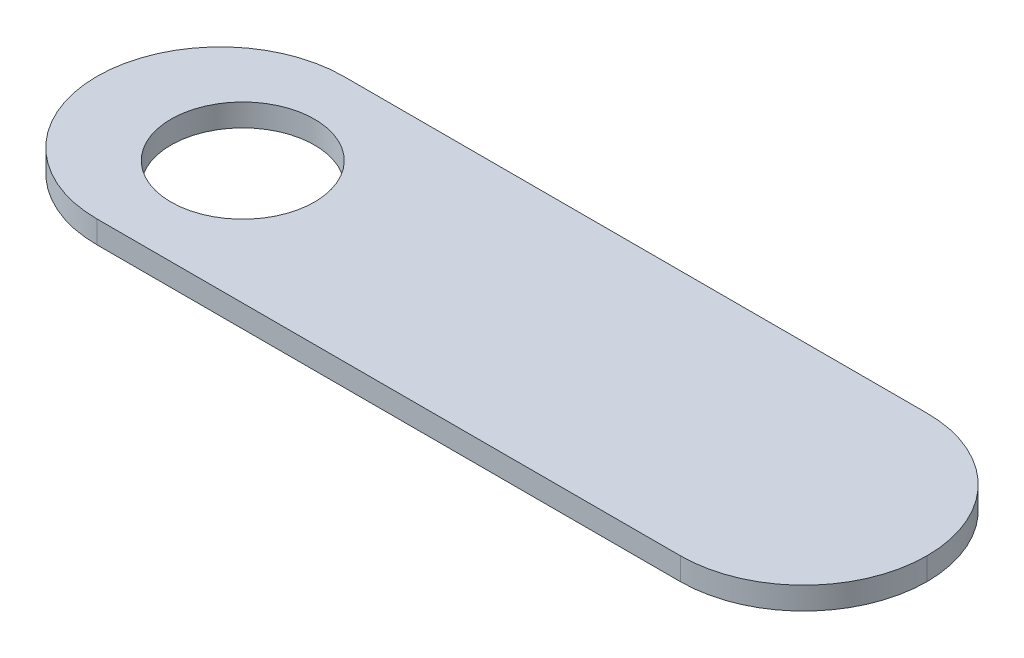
ISO-10303-21;
HEADER;
FILE_DESCRIPTION(('STEP AP214'),'2;1');
FILE_NAME('part.step','',(''),(''),'','','');
FILE_SCHEMA(('AUTOMOTIVE_DESIGN { 1 0 10303 214 1 1 1 1 }'));
ENDSEC;
DATA;
#1=APPLICATION_CONTEXT('core data for automotive mechanical design processes');
#2=APPLICATION_PROTOCOL_DEFINITION('international standard','automotive_design',2000,#1);
#3=PRODUCT_CONTEXT('',#1,'mechanical');
#4=PRODUCT('Part','Part','',(#3));
#5=PRODUCT_RELATED_PRODUCT_CATEGORY('part','',(#4));
#6=PRODUCT_DEFINITION_FORMATION('','',#4);
#7=PRODUCT_DEFINITION_CONTEXT('part definition',#1,'design');
#8=PRODUCT_DEFINITION('design','',#6,#7);
#9=PRODUCT_DEFINITION_SHAPE('','',#8);
#10=(LENGTH_UNIT() NAMED_UNIT(*) SI_UNIT(.MILLI.,.METRE.));
#11=(NAMED_UNIT(*) PLANE_ANGLE_UNIT() SI_UNIT($,.RADIAN.));
#12=(NAMED_UNIT(*) SI_UNIT($,.STERADIAN.) SOLID_ANGLE_UNIT());
#13=UNCERTAINTY_MEASURE_WITH_UNIT(LENGTH_MEASURE(1.E-05),#10,'distance_accuracy_value','');
#14=(GEOMETRIC_REPRESENTATION_CONTEXT(3) GLOBAL_UNCERTAINTY_ASSIGNED_CONTEXT((#13)) GLOBAL_UNIT_ASSIGNED_CONTEXT((#10,
#11,#12)) REPRESENTATION_CONTEXT('',''));
#15=CARTESIAN_POINT('',(0.,0.,0.));
#16=DIRECTION('',(0.,0.,1.));
#17=DIRECTION('',(1.,0.,0.));
#18=AXIS2_PLACEMENT_3D('',#15,#16,#17);
#19=CARTESIAN_POINT('',(-9.25,0.5,-2.75));
#20=DIRECTION('',(0.,0.,1.));
#21=DIRECTION('',(1.,0.,0.));
#22=AXIS2_PLACEMENT_3D('',#19,#20,#21);
#23=PLANE('',#22);
#24=DIRECTION('',(-1.,0.,0.));
#25=VECTOR('',#24,1.);
#26=CARTESIAN_POINT('',(-9.25,0.,-2.75));
#27=LINE('',#26,#25);
#28=CARTESIAN_POINT('',(6.5,0.,-2.75));
#29=VERTEX_POINT('',#28);
#30=CARTESIAN_POINT('',(-6.5,0.,-2.75));
#31=VERTEX_POINT('',#30);
#32=EDGE_CURVE('E99',#29,#31,#27,.T.);
#33=ORIENTED_EDGE('',*,*,#32,.T.);
#34=DIRECTION('',(0.,-1.,0.));
#35=VECTOR('',#34,1.);
#36=CARTESIAN_POINT('',(-6.5,0.5,-2.75));
#37=LINE('',#36,#35);
#38=CARTESIAN_POINT('',(-6.5,0.5,-2.75));
#39=VERTEX_POINT('',#38);
#40=EDGE_CURVE('E117',#31,#39,#37,.F.);
#41=ORIENTED_EDGE('',*,*,#40,.T.);
#42=DIRECTION('',(-1.,0.,0.));
#43=VECTOR('',#42,1.);
#44=CARTESIAN_POINT('',(-9.25,0.5,-2.75));
#45=LINE('',#44,#43);
#46=CARTESIAN_POINT('',(6.5,0.5,-2.75));
#47=VERTEX_POINT('',#46);
#48=EDGE_CURVE('E138',#47,#39,#45,.T.);
#49=ORIENTED_EDGE('',*,*,#48,.F.);
#50=DIRECTION('',(0.,-1.,0.));
#51=VECTOR('',#50,1.);
#52=CARTESIAN_POINT('',(6.5,0.5,-2.75));
#53=LINE('',#52,#51);
#54=EDGE_CURVE('E115',#47,#29,#53,.T.);
#55=ORIENTED_EDGE('',*,*,#54,.T.);
#56=EDGE_LOOP('',(#33,#41,#49,#55));
#57=FACE_BOUND('',#56,.T.);
#58=ADVANCED_FACE('F35',(#57),#23,.F.);
#59=CARTESIAN_POINT('',(-9.25,0.5,2.75));
#60=DIRECTION('',(0.,0.,-1.));
#61=DIRECTION('',(-1.,0.,0.));
#62=AXIS2_PLACEMENT_3D('',#59,#60,#61);
#63=PLANE('',#62);
#64=DIRECTION('',(1.,0.,0.));
#65=VECTOR('',#64,1.);
#66=CARTESIAN_POINT('',(-9.25,0.5,2.75));
#67=LINE('',#66,#65);
#68=CARTESIAN_POINT('',(-6.5,0.5,2.75));
#69=VERTEX_POINT('',#68);
#70=CARTESIAN_POINT('',(6.5,0.5,2.75));
#71=VERTEX_POINT('',#70);
#72=EDGE_CURVE('E102',#69,#71,#67,.T.);
#73=ORIENTED_EDGE('',*,*,#72,.F.);
#74=DIRECTION('',(0.,-1.,0.));
#75=VECTOR('',#74,1.);
#76=CARTESIAN_POINT('',(-6.5,0.5,2.75));
#77=LINE('',#76,#75);
#78=CARTESIAN_POINT('',(-6.5,0.,2.75));
#79=VERTEX_POINT('',#78);
#80=EDGE_CURVE('E11',#69,#79,#77,.T.);
#81=ORIENTED_EDGE('',*,*,#80,.T.);
#82=DIRECTION('',(1.,0.,0.));
#83=VECTOR('',#82,1.);
#84=CARTESIAN_POINT('',(-9.25,0.,2.75));
#85=LINE('',#84,#83);
#86=CARTESIAN_POINT('',(6.5,0.,2.75));
#87=VERTEX_POINT('',#86);
#88=EDGE_CURVE('E141',#79,#87,#85,.T.);
#89=ORIENTED_EDGE('',*,*,#88,.T.);
#90=DIRECTION('',(0.,-1.,0.));
#91=VECTOR('',#90,1.);
#92=CARTESIAN_POINT('',(6.5,0.5,2.75));
#93=LINE('',#92,#91);
#94=EDGE_CURVE('E44',#87,#71,#93,.F.);
#95=ORIENTED_EDGE('',*,*,#94,.T.);
#96=EDGE_LOOP('',(#73,#81,#89,#95));
#97=FACE_BOUND('',#96,.T.);
#98=ADVANCED_FACE('F144',(#97),#63,.F.);
#99=CARTESIAN_POINT('',(0.,0.5,0.));
#100=DIRECTION('',(0.,-1.,0.));
#101=DIRECTION('',(0.,0.,-1.));
#102=AXIS2_PLACEMENT_3D('',#99,#100,#101);
#103=PLANE('',#102);
#104=CARTESIAN_POINT('',(-6.,0.500000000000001,0.));
#105=DIRECTION('',(0.,1.,0.));
#106=DIRECTION('',(0.,0.,1.));
#107=AXIS2_PLACEMENT_3D('',#104,#105,#106);
#108=CIRCLE('',#107,1.59999999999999);
#109=CARTESIAN_POINT('',(-6.,0.500000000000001,1.59999999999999));
#110=VERTEX_POINT('',#109);
#111=EDGE_CURVE('E126',#110,#110,#108,.T.);
#112=ORIENTED_EDGE('',*,*,#111,.F.);
#113=EDGE_LOOP('',(#112));
#114=FACE_BOUND('',#113,.T.);
#115=ORIENTED_EDGE('',*,*,#48,.T.);
#116=CARTESIAN_POINT('',(-6.5,0.5,0.));
#117=DIRECTION('',(0.,-1.,0.));
#118=DIRECTION('',(0.,0.,-1.));
#119=AXIS2_PLACEMENT_3D('',#116,#117,#118);
#120=CIRCLE('',#119,2.75);
#121=CARTESIAN_POINT('',(-9.25,0.5,0.));
#122=VERTEX_POINT('',#121);
#123=EDGE_CURVE('E123',#39,#122,#120,.F.);
#124=ORIENTED_EDGE('',*,*,#123,.T.);
#125=CARTESIAN_POINT('',(-6.5,0.5,0.));
#126=DIRECTION('',(0.,-1.,0.));
#127=DIRECTION('',(0.,0.,-1.));
#128=AXIS2_PLACEMENT_3D('',#125,#126,#127);
#129=CIRCLE('',#128,2.75);
#130=EDGE_CURVE('E60',#122,#69,#129,.F.);
#131=ORIENTED_EDGE('',*,*,#130,.T.);
#132=ORIENTED_EDGE('',*,*,#72,.T.);
#133=CARTESIAN_POINT('',(6.5,0.5,0.));
#134=DIRECTION('',(0.,-1.,0.));
#135=DIRECTION('',(0.,0.,-1.));
#136=AXIS2_PLACEMENT_3D('',#133,#134,#135);
#137=CIRCLE('',#136,2.75);
#138=CARTESIAN_POINT('',(9.25,0.5,0.));
#139=VERTEX_POINT('',#138);
#140=EDGE_CURVE('E52',#71,#139,#137,.F.);
#141=ORIENTED_EDGE('',*,*,#140,.T.);
#142=CARTESIAN_POINT('',(6.5,0.5,0.));
#143=DIRECTION('',(0.,-1.,0.));
#144=DIRECTION('',(0.,0.,-1.));
#145=AXIS2_PLACEMENT_3D('',#142,#143,#144);
#146=CIRCLE('',#145,2.75);
#147=EDGE_CURVE('E105',#139,#47,#146,.F.);
#148=ORIENTED_EDGE('',*,*,#147,.T.);
#149=EDGE_LOOP('',(#115,#124,#131,#132,#141,#148));
#150=FACE_BOUND('',#149,.T.);
#151=ADVANCED_FACE('F153',(#114,#150),#103,.F.);
#152=CARTESIAN_POINT('',(0.,0.,0.));
#153=DIRECTION('',(0.,-1.,0.));
#154=DIRECTION('',(0.,0.,-1.));
#155=AXIS2_PLACEMENT_3D('',#152,#153,#154);
#156=PLANE('',#155);
#157=CARTESIAN_POINT('',(-6.,0.,0.));
#158=DIRECTION('',(0.,1.,0.));
#159=DIRECTION('',(0.,0.,1.));
#160=AXIS2_PLACEMENT_3D('',#157,#158,#159);
#161=CIRCLE('',#160,1.6);
#162=CARTESIAN_POINT('',(-6.,0.,1.6));
#163=VERTEX_POINT('',#162);
#164=EDGE_CURVE('E131',#163,#163,#161,.T.);
#165=ORIENTED_EDGE('',*,*,#164,.T.);
#166=EDGE_LOOP('',(#165));
#167=FACE_BOUND('',#166,.T.);
#168=CARTESIAN_POINT('',(-6.5,0.,0.));
#169=DIRECTION('',(0.,-1.,0.));
#170=DIRECTION('',(0.,0.,-1.));
#171=AXIS2_PLACEMENT_3D('',#168,#169,#170);
#172=CIRCLE('',#171,2.75);
#173=CARTESIAN_POINT('',(-9.25,0.,0.));
#174=VERTEX_POINT('',#173);
#175=EDGE_CURVE('E108',#79,#174,#172,.T.);
#176=ORIENTED_EDGE('',*,*,#175,.T.);
#177=CARTESIAN_POINT('',(-6.5,0.,0.));
#178=DIRECTION('',(0.,-1.,0.));
#179=DIRECTION('',(0.,0.,-1.));
#180=AXIS2_PLACEMENT_3D('',#177,#178,#179);
#181=CIRCLE('',#180,2.75);
#182=EDGE_CURVE('E110',#174,#31,#181,.T.);
#183=ORIENTED_EDGE('',*,*,#182,.T.);
#184=ORIENTED_EDGE('',*,*,#32,.F.);
#185=CARTESIAN_POINT('',(6.5,0.,0.));
#186=DIRECTION('',(0.,-1.,0.));
#187=DIRECTION('',(0.,0.,-1.));
#188=AXIS2_PLACEMENT_3D('',#185,#186,#187);
#189=CIRCLE('',#188,2.75);
#190=CARTESIAN_POINT('',(9.25,0.,0.));
#191=VERTEX_POINT('',#190);
#192=EDGE_CURVE('E91',#29,#191,#189,.T.);
#193=ORIENTED_EDGE('',*,*,#192,.T.);
#194=CARTESIAN_POINT('',(6.5,0.,0.));
#195=DIRECTION('',(0.,-1.,0.));
#196=DIRECTION('',(0.,0.,-1.));
#197=AXIS2_PLACEMENT_3D('',#194,#195,#196);
#198=CIRCLE('',#197,2.75);
#199=EDGE_CURVE('E96',#191,#87,#198,.T.);
#200=ORIENTED_EDGE('',*,*,#199,.T.);
#201=ORIENTED_EDGE('',*,*,#88,.F.);
#202=EDGE_LOOP('',(#176,#183,#184,#193,#200,#201));
#203=FACE_BOUND('',#202,.T.);
#204=ADVANCED_FACE('F93',(#167,#203),#156,.T.);
#205=CARTESIAN_POINT('',(-6.,0.5,0.));
#206=DIRECTION('',(0.,1.,0.));
#207=DIRECTION('',(0.,0.,1.));
#208=AXIS2_PLACEMENT_3D('',#205,#206,#207);
#209=CYLINDRICAL_SURFACE('',#208,1.59999999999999);
#210=ORIENTED_EDGE('',*,*,#164,.F.);
#211=EDGE_LOOP('',(#210));
#212=FACE_BOUND('',#211,.T.);
#213=ORIENTED_EDGE('',*,*,#111,.T.);
#214=EDGE_LOOP('',(#213));
#215=FACE_BOUND('',#214,.T.);
#216=ADVANCED_FACE('F161',(#212,#215),#209,.F.);
#217=CARTESIAN_POINT('',(-6.5,0.5,0.));
#218=DIRECTION('',(0.,-1.,0.));
#219=DIRECTION('',(0.,0.,-1.));
#220=AXIS2_PLACEMENT_3D('',#217,#218,#219);
#221=CYLINDRICAL_SURFACE('',#220,2.75);
#222=ORIENTED_EDGE('',*,*,#80,.F.);
#223=ORIENTED_EDGE('',*,*,#130,.F.);
#224=DIRECTION('',(0.,-1.,0.));
#225=VECTOR('',#224,1.);
#226=CARTESIAN_POINT('',(-9.25,0.5,0.));
#227=LINE('',#226,#225);
#228=EDGE_CURVE('E106',#174,#122,#227,.F.);
#229=ORIENTED_EDGE('',*,*,#228,.F.);
#230=ORIENTED_EDGE('',*,*,#175,.F.);
#231=EDGE_LOOP('',(#222,#223,#229,#230));
#232=FACE_BOUND('',#231,.T.);
#233=ADVANCED_FACE('F148',(#232),#221,.T.);
#234=CARTESIAN_POINT('',(-6.5,0.5,0.));
#235=DIRECTION('',(0.,-1.,0.));
#236=DIRECTION('',(0.,0.,-1.));
#237=AXIS2_PLACEMENT_3D('',#234,#235,#236);
#238=CYLINDRICAL_SURFACE('',#237,2.75);
#239=ORIENTED_EDGE('',*,*,#123,.F.);
#240=ORIENTED_EDGE('',*,*,#40,.F.);
#241=ORIENTED_EDGE('',*,*,#182,.F.);
#242=ORIENTED_EDGE('',*,*,#228,.T.);
#243=EDGE_LOOP('',(#239,#240,#241,#242));
#244=FACE_BOUND('',#243,.T.);
#245=ADVANCED_FACE('F150',(#244),#238,.T.);
#246=CARTESIAN_POINT('',(6.5,0.5,0.));
#247=DIRECTION('',(0.,-1.,0.));
#248=DIRECTION('',(0.,0.,-1.));
#249=AXIS2_PLACEMENT_3D('',#246,#247,#248);
#250=CYLINDRICAL_SURFACE('',#249,2.75);
#251=ORIENTED_EDGE('',*,*,#54,.F.);
#252=ORIENTED_EDGE('',*,*,#147,.F.);
#253=DIRECTION('',(0.,-1.,0.));
#254=VECTOR('',#253,1.);
#255=CARTESIAN_POINT('',(9.25,0.5,0.));
#256=LINE('',#255,#254);
#257=EDGE_CURVE('E39',#191,#139,#256,.F.);
#258=ORIENTED_EDGE('',*,*,#257,.F.);
#259=ORIENTED_EDGE('',*,*,#192,.F.);
#260=EDGE_LOOP('',(#251,#252,#258,#259));
#261=FACE_BOUND('',#260,.T.);
#262=ADVANCED_FACE('F37',(#261),#250,.T.);
#263=CARTESIAN_POINT('',(6.5,0.5,0.));
#264=DIRECTION('',(0.,-1.,0.));
#265=DIRECTION('',(0.,0.,-1.));
#266=AXIS2_PLACEMENT_3D('',#263,#264,#265);
#267=CYLINDRICAL_SURFACE('',#266,2.75);
#268=ORIENTED_EDGE('',*,*,#140,.F.);
#269=ORIENTED_EDGE('',*,*,#94,.F.);
#270=ORIENTED_EDGE('',*,*,#199,.F.);
#271=ORIENTED_EDGE('',*,*,#257,.T.);
#272=EDGE_LOOP('',(#268,#269,#270,#271));
#273=FACE_BOUND('',#272,.T.);
#274=ADVANCED_FACE('F107',(#273),#267,.T.);
#275=CLOSED_SHELL('',(#58,#98,#151,#204,#216,#233,#245,#262,#274));
#276=MANIFOLD_SOLID_BREP('B2',#275);
#277=ADVANCED_BREP_SHAPE_REPRESENTATION('',(#18,#276),#14);
#278=SHAPE_DEFINITION_REPRESENTATION(#9,#277);
ENDSEC;
END-ISO-10303-21;
